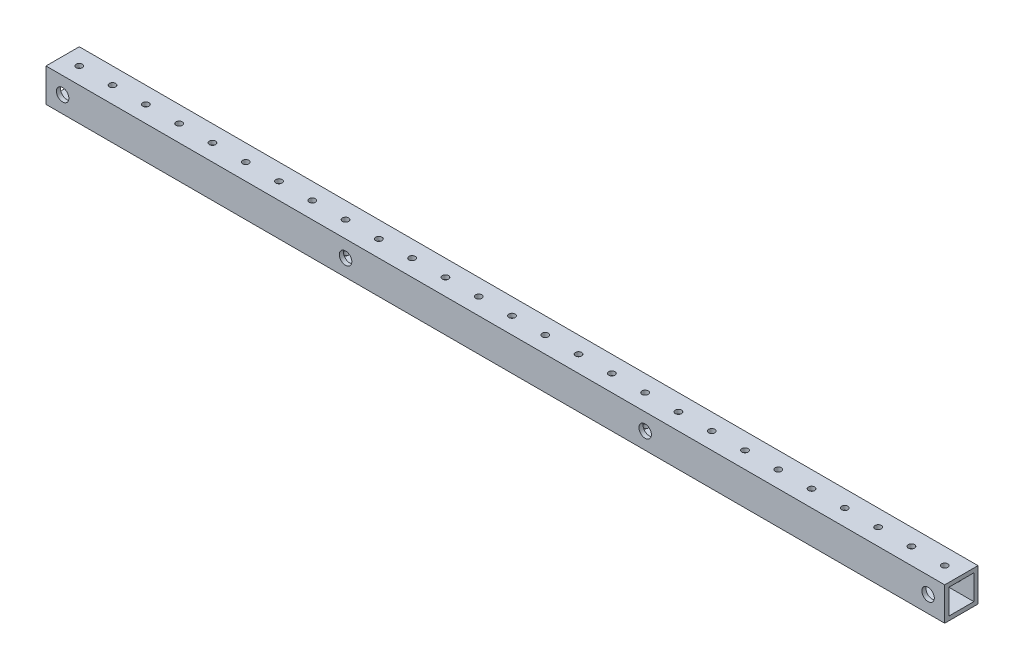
from build123d import *

# Parameters (mm, degrees)
SKETCH1_W           = 25.4
SKETCH1_H           = 25.4
SKETCH1_W_2         = 19.05
SKETCH1_H_2         = 19.05
BOSS_EXTRUDE1_DEPTH = 342.9
CUT_EXTRUDE1_REACH  = 346.074
SKETCH2_R           = 4.7625
SKETCH4_R           = 2.38125
CUT_EXTRUDE3_DEPTH  = 345.073916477
LPATTERN1_COUNT     = 30
LPATTERN1_PITCH     = 25.4
SKETCH5_R           = 2.4892
CUT_EXTRUDE4_DEPTH  = 344.854112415


with BuildPart() as part:
    # Sketch1 → Boss-Extrude1 (new, symmetric)
    with BuildSketch(Plane(origin=(0, 0, 0), x_dir=(0, 0, -1), z_dir=(1, 0, 0))):
        Rectangle(SKETCH1_W, SKETCH1_H)
        Rectangle(SKETCH1_W_2, SKETCH1_H_2, mode=Mode.SUBTRACT)
    extrude(amount=BOSS_EXTRUDE1_DEPTH, both=True)

    # Sketch2 → Cut-Extrude1 (cut, up to next)
    with BuildSketch(Plane(origin=(0, 0, 12.7), x_dir=(-1, 0, 0), z_dir=(0, 0, -1)), mode=Mode.PRIVATE) as cut_extrude1_sk1:
        with Locations(Location((330.2, 0, 0), (0, 0, 180))):
            Circle(SKETCH2_R)
    cut_extrude1_tool1 = extrude(cut_extrude1_sk1.sketch, amount=CUT_EXTRUDE1_REACH, mode=Mode.PRIVATE) & part.part
    # Sketch2 → Cut-Extrude1 (cut, up to next)
    with BuildSketch(Plane(origin=(0, 0, 12.7), x_dir=(-1, 0, 0), z_dir=(0, 0, -1)), mode=Mode.PRIVATE) as cut_extrude1_sk2:
        with Locations(Location((114.3, 0, 0), (0, 0, 180))):
            Circle(SKETCH2_R)
    cut_extrude1_tool2 = extrude(cut_extrude1_sk2.sketch, amount=CUT_EXTRUDE1_REACH, mode=Mode.PRIVATE) & part.part
    # Sketch2 → Cut-Extrude1 (cut, up to next)
    with BuildSketch(Plane(origin=(0, 0, 12.7), x_dir=(-1, 0, 0), z_dir=(0, 0, -1)), mode=Mode.PRIVATE) as cut_extrude1_sk3:
        with Locations(Location((-114.3, 0, 0), (0, 0, 180))):
            Circle(SKETCH2_R)
    cut_extrude1_tool3 = extrude(cut_extrude1_sk3.sketch, amount=CUT_EXTRUDE1_REACH, mode=Mode.PRIVATE) & part.part
    # Sketch2 → Cut-Extrude1 (cut, up to next)
    with BuildSketch(Plane(origin=(0, 0, 12.7), x_dir=(-1, 0, 0), z_dir=(0, 0, -1)), mode=Mode.PRIVATE) as cut_extrude1_sk4:
        with Locations(Location((-330.2, 0, 0), (0, 0, 180))):
            Circle(SKETCH2_R)
    cut_extrude1_tool4 = extrude(cut_extrude1_sk4.sketch, amount=CUT_EXTRUDE1_REACH, mode=Mode.PRIVATE) & part.part
    add(cut_extrude1_tool1.solids().sort_by_distance((-330.2, 0, 12.7))[0], mode=Mode.SUBTRACT)
    add(cut_extrude1_tool2.solids().sort_by_distance((-114.3, 0, 12.7))[0], mode=Mode.SUBTRACT)
    add(cut_extrude1_tool3.solids().sort_by_distance((114.3, 0, 12.7))[0], mode=Mode.SUBTRACT)
    add(cut_extrude1_tool4.solids().sort_by_distance((330.2, 0, 12.7))[0], mode=Mode.SUBTRACT)

    # Sketch4 → Cut-Extrude3 (cut, through all)
    with BuildSketch(Plane(origin=(0, 12.7, 0), x_dir=(1, 0, 0), z_dir=(0, 1, 0))):
        with Locations(Location((-330.2, 0, 0), (0, 0, 270))):
            Circle(SKETCH4_R)
    cut_extrude3 = extrude(amount=-CUT_EXTRUDE3_DEPTH, mode=Mode.SUBTRACT)

    # LPattern1: Cut-Extrude3 ×30
    with Locations(*[(i * LPATTERN1_PITCH, 0, 0) for i in range(1, LPATTERN1_COUNT)]):
        add(cut_extrude3, mode=Mode.SUBTRACT)

    # Sketch5 → Cut-Extrude4 (cut, through all)
    with BuildSketch(Plane.XY.offset(-9.525)):
        with Locations((330.2, 0)):
            Circle(SKETCH5_R)
        with Locations((114.3, 0)):
            Circle(SKETCH5_R)
        with Locations((-114.3, 0)):
            Circle(SKETCH5_R)
        with Locations((-330.2, 0)):
            Circle(SKETCH5_R)
    extrude(amount=-CUT_EXTRUDE4_DEPTH, mode=Mode.SUBTRACT)


solid = part.part
